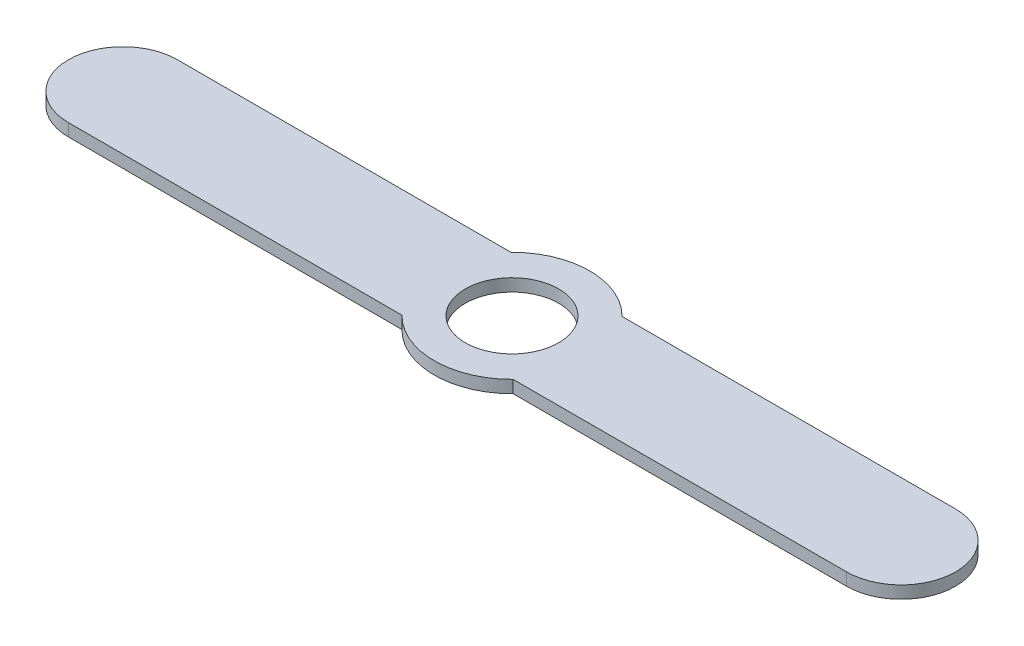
from build123d import *

# Parameters (mm, degrees)
SKETCH1_R           = 4.445
SKETCH1_R_2         = 6.35
SKETCH1_W           = 63.5
SKETCH1_H           = 8.89
BOSS_EXTRUDE1_DEPTH = 1.016
SKETCH2_R           = 3.81
CUT_EXTRUDE1_DEPTH  = 37.761838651
SCALE1_SCALE        = 0.5


with BuildPart() as part:
    # Sketch1 → Boss-Extrude1 (new body)
    with BuildSketch(Plane(origin=(0, 0, 0), x_dir=(1, 0, 0), z_dir=(0, 1, 0))):
        with Locations((-31.75, 0)):
            Circle(SKETCH1_R)
        with Locations((31.75, 0)):
            Circle(SKETCH1_R)
        Circle(SKETCH1_R_2)
        Rectangle(SKETCH1_W, SKETCH1_H)
    extrude(amount=BOSS_EXTRUDE1_DEPTH)

    # Sketch2 → Cut-Extrude1 (cut, through all)
    with BuildSketch(Plane(origin=(0, 1.016, 0), x_dir=(1, 0, 0), z_dir=(0, 1, 0))):
        with Locations(Location((0, 0, 0), (0, 0, 270))):
            Circle(SKETCH2_R)
    extrude(amount=-CUT_EXTRUDE1_DEPTH, mode=Mode.SUBTRACT)


with BuildPart() as part_1:
    # Scale1: scaled about (0, 0.508, 0)
    add(part.part.scale(SCALE1_SCALE).moved(Location((0, 0.254, 0))))


solid = part_1.part
